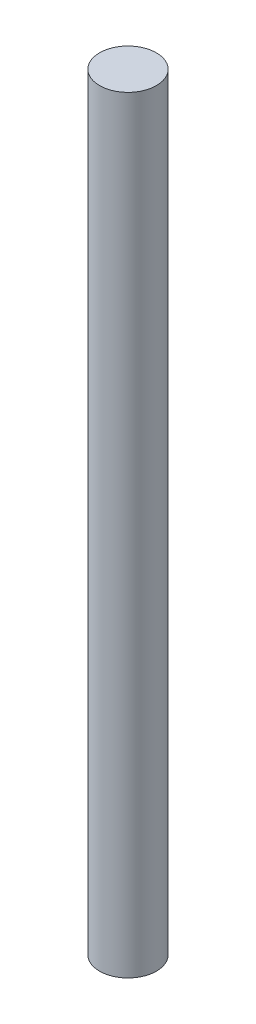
ISO-10303-21;
HEADER;
FILE_DESCRIPTION(('STEP AP214'),'2;1');
FILE_NAME('part.step','',(''),(''),'','','');
FILE_SCHEMA(('AUTOMOTIVE_DESIGN { 1 0 10303 214 1 1 1 1 }'));
ENDSEC;
DATA;
#1=APPLICATION_CONTEXT('core data for automotive mechanical design processes');
#2=APPLICATION_PROTOCOL_DEFINITION('international standard','automotive_design',2000,#1);
#3=PRODUCT_CONTEXT('',#1,'mechanical');
#4=PRODUCT('Part','Part','',(#3));
#5=PRODUCT_RELATED_PRODUCT_CATEGORY('part','',(#4));
#6=PRODUCT_DEFINITION_FORMATION('','',#4);
#7=PRODUCT_DEFINITION_CONTEXT('part definition',#1,'design');
#8=PRODUCT_DEFINITION('design','',#6,#7);
#9=PRODUCT_DEFINITION_SHAPE('','',#8);
#10=(LENGTH_UNIT() NAMED_UNIT(*) SI_UNIT(.MILLI.,.METRE.));
#11=(NAMED_UNIT(*) PLANE_ANGLE_UNIT() SI_UNIT($,.RADIAN.));
#12=(NAMED_UNIT(*) SI_UNIT($,.STERADIAN.) SOLID_ANGLE_UNIT());
#13=UNCERTAINTY_MEASURE_WITH_UNIT(LENGTH_MEASURE(1.E-05),#10,'distance_accuracy_value','');
#14=(GEOMETRIC_REPRESENTATION_CONTEXT(3) GLOBAL_UNCERTAINTY_ASSIGNED_CONTEXT((#13)) GLOBAL_UNIT_ASSIGNED_CONTEXT((#10,
#11,#12)) REPRESENTATION_CONTEXT('',''));
#15=CARTESIAN_POINT('',(0.,0.,0.));
#16=DIRECTION('',(0.,0.,1.));
#17=DIRECTION('',(1.,0.,0.));
#18=AXIS2_PLACEMENT_3D('',#15,#16,#17);
#19=CARTESIAN_POINT('',(0.,108.,0.));
#20=DIRECTION('',(0.,-1.,0.));
#21=DIRECTION('',(0.,0.,-1.));
#22=AXIS2_PLACEMENT_3D('',#19,#20,#21);
#23=CYLINDRICAL_SURFACE('',#22,4.);
#24=CARTESIAN_POINT('',(0.,108.,0.));
#25=DIRECTION('',(0.,1.,0.));
#26=DIRECTION('',(0.,0.,1.));
#27=AXIS2_PLACEMENT_3D('',#24,#25,#26);
#28=CIRCLE('',#27,4.);
#29=CARTESIAN_POINT('',(0.,108.,4.));
#30=VERTEX_POINT('',#29);
#31=EDGE_CURVE('E10',#30,#30,#28,.T.);
#32=ORIENTED_EDGE('',*,*,#31,.F.);
#33=EDGE_LOOP('',(#32));
#34=FACE_BOUND('',#33,.T.);
#35=CARTESIAN_POINT('',(0.,0.,0.));
#36=DIRECTION('',(0.,1.,0.));
#37=DIRECTION('',(0.,0.,1.));
#38=AXIS2_PLACEMENT_3D('',#35,#36,#37);
#39=CIRCLE('',#38,4.);
#40=CARTESIAN_POINT('',(0.,0.,4.));
#41=VERTEX_POINT('',#40);
#42=EDGE_CURVE('E33',#41,#41,#39,.T.);
#43=ORIENTED_EDGE('',*,*,#42,.T.);
#44=EDGE_LOOP('',(#43));
#45=FACE_BOUND('',#44,.T.);
#46=ADVANCED_FACE('F30',(#34,#45),#23,.T.);
#47=CARTESIAN_POINT('',(0.,108.,0.));
#48=DIRECTION('',(0.,1.,0.));
#49=DIRECTION('',(0.,0.,1.));
#50=AXIS2_PLACEMENT_3D('',#47,#48,#49);
#51=PLANE('',#50);
#52=ORIENTED_EDGE('',*,*,#31,.T.);
#53=EDGE_LOOP('',(#52));
#54=FACE_BOUND('',#53,.T.);
#55=ADVANCED_FACE('F45',(#54),#51,.T.);
#56=CARTESIAN_POINT('',(0.,0.,0.));
#57=DIRECTION('',(0.,1.,0.));
#58=DIRECTION('',(0.,0.,1.));
#59=AXIS2_PLACEMENT_3D('',#56,#57,#58);
#60=PLANE('',#59);
#61=ORIENTED_EDGE('',*,*,#42,.F.);
#62=EDGE_LOOP('',(#61));
#63=FACE_BOUND('',#62,.T.);
#64=ADVANCED_FACE('F43',(#63),#60,.F.);
#65=CLOSED_SHELL('',(#46,#55,#64));
#66=MANIFOLD_SOLID_BREP('B2',#65);
#67=ADVANCED_BREP_SHAPE_REPRESENTATION('',(#18,#66),#14);
#68=SHAPE_DEFINITION_REPRESENTATION(#9,#67);
ENDSEC;
END-ISO-10303-21;
